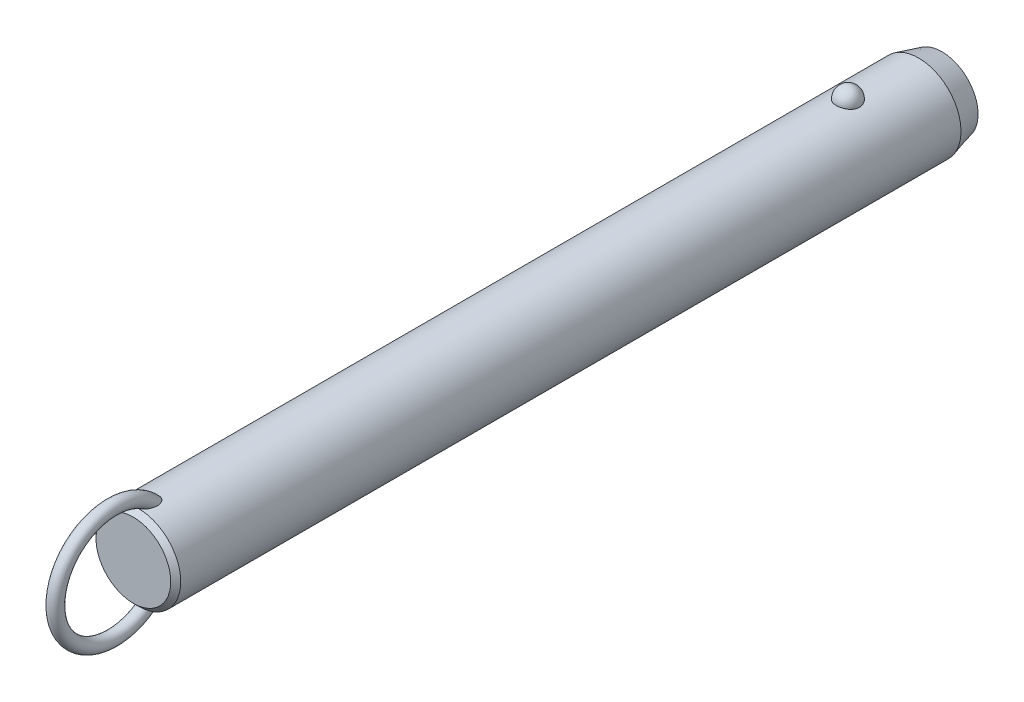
ISO-10303-21;
HEADER;
FILE_DESCRIPTION(('STEP AP214'),'2;1');
FILE_NAME('part.step','',(''),(''),'','','');
FILE_SCHEMA(('AUTOMOTIVE_DESIGN { 1 0 10303 214 1 1 1 1 }'));
ENDSEC;
DATA;
#1=APPLICATION_CONTEXT('core data for automotive mechanical design processes');
#2=APPLICATION_PROTOCOL_DEFINITION('international standard','automotive_design',2000,#1);
#3=PRODUCT_CONTEXT('',#1,'mechanical');
#4=PRODUCT('Part','Part','',(#3));
#5=PRODUCT_RELATED_PRODUCT_CATEGORY('part','',(#4));
#6=PRODUCT_DEFINITION_FORMATION('','',#4);
#7=PRODUCT_DEFINITION_CONTEXT('part definition',#1,'design');
#8=PRODUCT_DEFINITION('design','',#6,#7);
#9=PRODUCT_DEFINITION_SHAPE('','',#8);
#10=(LENGTH_UNIT() NAMED_UNIT(*) SI_UNIT(.MILLI.,.METRE.));
#11=(NAMED_UNIT(*) PLANE_ANGLE_UNIT() SI_UNIT($,.RADIAN.));
#12=(NAMED_UNIT(*) SI_UNIT($,.STERADIAN.) SOLID_ANGLE_UNIT());
#13=UNCERTAINTY_MEASURE_WITH_UNIT(LENGTH_MEASURE(1.E-05),#10,'distance_accuracy_value','');
#14=(GEOMETRIC_REPRESENTATION_CONTEXT(3) GLOBAL_UNCERTAINTY_ASSIGNED_CONTEXT((#13)) GLOBAL_UNIT_ASSIGNED_CONTEXT((#10,
#11,#12)) REPRESENTATION_CONTEXT('',''));
#15=CARTESIAN_POINT('',(0.,0.,0.));
#16=DIRECTION('',(0.,0.,1.));
#17=DIRECTION('',(1.,0.,0.));
#18=AXIS2_PLACEMENT_3D('',#15,#16,#17);
#19=CARTESIAN_POINT('',(0.,0.,198.1));
#20=DIRECTION('',(0.,0.,-1.));
#21=DIRECTION('',(-1.,0.,0.));
#22=AXIS2_PLACEMENT_3D('',#19,#20,#21);
#23=CYLINDRICAL_SURFACE('',#22,12.7);
#24=CARTESIAN_POINT('',(3.46661256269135,12.2177165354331,-3.50000000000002));
#25=CARTESIAN_POINT('',(3.4666090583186,12.2177194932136,-3.30432790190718));
#26=CARTESIAN_POINT('',(3.45063567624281,12.2222841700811,-3.10861112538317));
#27=CARTESIAN_POINT('',(3.38712451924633,12.2400345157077,-2.72271899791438));
#28=CARTESIAN_POINT('',(3.33957415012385,12.2532236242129,-2.53254588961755));
#29=CARTESIAN_POINT('',(3.2141234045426,12.286724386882,-2.16324948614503));
#30=CARTESIAN_POINT('',(3.13623639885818,12.3070329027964,-1.98412136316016));
#31=CARTESIAN_POINT('',(2.95205930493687,12.3525018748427,-1.6418059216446));
#32=CARTESIAN_POINT('',(2.84577003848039,12.3776621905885,-1.47861814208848));
#33=CARTESIAN_POINT('',(2.60688050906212,12.4301712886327,-1.17190583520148));
#34=CARTESIAN_POINT('',(2.47415697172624,12.4575299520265,-1.0284789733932));
#35=CARTESIAN_POINT('',(2.18615174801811,12.5112810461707,-0.766177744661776));
#36=CARTESIAN_POINT('',(2.03087002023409,12.5376734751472,-0.647303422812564));
#37=CARTESIAN_POINT('',(1.70237334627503,12.5864761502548,-0.437732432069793));
#38=CARTESIAN_POINT('',(1.52920948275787,12.6088972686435,-0.346958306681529));
#39=CARTESIAN_POINT('',(1.16944170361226,12.6473352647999,-0.195750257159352));
#40=CARTESIAN_POINT('',(0.982839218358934,12.663352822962,-0.135313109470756));
#41=CARTESIAN_POINT('',(0.604961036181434,12.6869706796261,-0.0473241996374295));
#42=CARTESIAN_POINT('',(0.41382314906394,12.6947125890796,-0.0192185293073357));
#43=CARTESIAN_POINT('',(0.0293827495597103,12.7014203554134,0.00517254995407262));
#44=CARTESIAN_POINT('',(-0.163919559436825,12.7003870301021,0.00146092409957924));
#45=CARTESIAN_POINT('',(-0.544374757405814,12.689735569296,-0.0373939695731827));
#46=CARTESIAN_POINT('',(-0.731575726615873,12.6802364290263,-0.0721015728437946));
#47=CARTESIAN_POINT('',(-1.09733277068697,12.6538333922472,-0.171364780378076));
#48=CARTESIAN_POINT('',(-1.27588869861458,12.6369293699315,-0.235920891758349));
#49=CARTESIAN_POINT('',(-1.6204698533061,12.5973946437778,-0.393548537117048));
#50=CARTESIAN_POINT('',(-1.78641865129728,12.5747321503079,-0.486778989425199));
#51=CARTESIAN_POINT('',(-2.10030671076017,12.5261316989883,-0.699110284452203));
#52=CARTESIAN_POINT('',(-2.24824419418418,12.5001934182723,-0.818213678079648));
#53=CARTESIAN_POINT('',(-2.52491489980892,12.4472906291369,-1.0815712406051));
#54=CARTESIAN_POINT('',(-2.65324222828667,12.4203160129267,-1.22624992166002));
#55=CARTESIAN_POINT('',(-2.88410007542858,12.3687509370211,-1.53528325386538));
#56=CARTESIAN_POINT('',(-2.98662883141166,12.3441606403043,-1.69963924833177));
#57=CARTESIAN_POINT('',(-3.16432417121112,12.2998199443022,-2.04548497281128));
#58=CARTESIAN_POINT('',(-3.23917525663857,12.2801261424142,-2.22714424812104));
#59=CARTESIAN_POINT('',(-3.35800573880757,12.248167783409,-2.60091389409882));
#60=CARTESIAN_POINT('',(-3.4019860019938,12.2359030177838,-2.79302397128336));
#61=CARTESIAN_POINT('',(-3.45784812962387,12.2202347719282,-3.18140279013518));
#62=CARTESIAN_POINT('',(-3.46986123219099,12.2167950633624,-3.37765118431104));
#63=CARTESIAN_POINT('',(-3.46186273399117,12.2190638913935,-3.76943689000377));
#64=CARTESIAN_POINT('',(-3.44185196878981,12.2247721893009,-3.96497421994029));
#65=CARTESIAN_POINT('',(-3.37048652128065,12.2446381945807,-4.34881728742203));
#66=CARTESIAN_POINT('',(-3.31928253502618,12.2587552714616,-4.53715319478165));
#67=CARTESIAN_POINT('',(-3.18693461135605,12.2938237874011,-4.9023172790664));
#68=CARTESIAN_POINT('',(-3.1057895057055,12.3147754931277,-5.07914500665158));
#69=CARTESIAN_POINT('',(-2.91506431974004,12.3613125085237,-5.41732059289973));
#70=CARTESIAN_POINT('',(-2.80533587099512,12.3869217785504,-5.57858147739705));
#71=CARTESIAN_POINT('',(-2.560414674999,12.4398525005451,-5.88013283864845));
#72=CARTESIAN_POINT('',(-2.42522099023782,12.4671740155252,-6.02042254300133));
#73=CARTESIAN_POINT('',(-2.1323357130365,12.5205965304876,-6.27662798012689));
#74=CARTESIAN_POINT('',(-1.97456596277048,12.5466928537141,-6.39245542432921));
#75=CARTESIAN_POINT('',(-1.64115839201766,12.5946384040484,-6.59583547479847));
#76=CARTESIAN_POINT('',(-1.46552179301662,12.6164879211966,-6.68339001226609));
#77=CARTESIAN_POINT('',(-1.10356050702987,12.6532533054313,-6.82682153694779));
#78=CARTESIAN_POINT('',(-0.9173913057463,12.6682500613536,-6.88306988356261));
#79=CARTESIAN_POINT('',(-0.537836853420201,12.6900288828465,-6.96386887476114));
#80=CARTESIAN_POINT('',(-0.344452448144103,12.6968119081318,-6.98842322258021));
#81=CARTESIAN_POINT('',(0.0402577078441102,12.7013667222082,-7.00496469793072));
#82=CARTESIAN_POINT('',(0.231556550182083,12.6993008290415,-6.99753844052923));
#83=CARTESIAN_POINT('',(0.610105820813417,12.6867505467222,-6.95166366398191));
#84=CARTESIAN_POINT('',(0.797356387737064,12.6762664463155,-6.91321620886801));
#85=CARTESIAN_POINT('',(1.16186657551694,12.6480587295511,-6.80658431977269));
#86=CARTESIAN_POINT('',(1.33915951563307,12.6303611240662,-6.73850666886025));
#87=CARTESIAN_POINT('',(1.67968518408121,12.5896027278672,-6.57450875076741));
#88=CARTESIAN_POINT('',(1.84291705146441,12.5665416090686,-6.47858678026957));
#89=CARTESIAN_POINT('',(2.15340192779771,12.5171072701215,-6.25982455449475));
#90=CARTESIAN_POINT('',(2.30037831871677,12.4906895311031,-6.13660186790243));
#91=CARTESIAN_POINT('',(2.5717412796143,12.4376567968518,-5.86739587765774));
#92=CARTESIAN_POINT('',(2.69612388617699,12.4110417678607,-5.72140858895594));
#93=CARTESIAN_POINT('',(2.92107785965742,12.360051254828,-5.40794137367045));
#94=CARTESIAN_POINT('',(3.02121329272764,12.3357209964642,-5.24014110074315));
#95=CARTESIAN_POINT('',(3.19236291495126,12.2925446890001,-4.88969865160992));
#96=CARTESIAN_POINT('',(3.26338839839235,12.2736965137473,-4.70706226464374));
#97=CARTESIAN_POINT('',(3.36788038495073,12.245404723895,-4.35469510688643));
#98=CARTESIAN_POINT('',(3.40484026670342,12.2351018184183,-4.18605935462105));
#99=CARTESIAN_POINT('',(3.45420764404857,12.2212564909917,-3.84496058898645));
#100=CARTESIAN_POINT('',(3.46661565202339,12.2177139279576,-3.67249765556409));
#101=CARTESIAN_POINT('',(3.46661256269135,12.2177165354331,-3.50000000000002));
#102=B_SPLINE_CURVE_WITH_KNOTS('',3,(#24,#25,#26,#27,#28,#29,#30,#31,#32,#33,#34,#35,#36,#37,
#38,#39,#40,#41,#42,#43,#44,#45,#46,#47,#48,#49,#50,#51,#52,#53,#54,#55,#56,#57,#58,#59,#60,#61,
#62,#63,#64,#65,#66,#67,#68,#69,#70,#71,#72,#73,#74,#75,#76,#77,#78,#79,#80,#81,#82,#83,#84,#85,
#86,#87,#88,#89,#90,#91,#92,#93,#94,#95,#96,#97,#98,#99,#100,#101),.UNSPECIFIED.,.T.,.F.,(4,2,2,
2,2,2,2,2,2,2,2,2,2,2,2,2,2,2,2,2,2,2,2,2,2,2,2,2,2,2,2,2,2,2,2,2,2,2,4),(0.,0.586396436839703,
1.17302689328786,1.7593990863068,2.34575431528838,2.93491084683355,3.52406845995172,
4.11158733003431,4.69904375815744,5.2762784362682,5.85345931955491,6.42265312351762,
6.99185659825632,7.56427334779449,8.136746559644,8.71981013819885,9.3029135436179,
9.89247258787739,10.4820150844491,11.0691335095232,11.6562366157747,12.2405256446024,
12.8248374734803,13.412244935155,13.9996740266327,14.5891883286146,15.1786623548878,
15.7609861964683,16.3432419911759,16.9148635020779,17.4864654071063,18.0560241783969,
18.6256177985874,19.2037609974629,19.7820055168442,20.3699810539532,20.957728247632,
21.4746855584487,21.9916320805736),.UNSPECIFIED.);
#103=CARTESIAN_POINT('',(3.46661256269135,12.2177165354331,-3.50000000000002));
#104=VERTEX_POINT('',#103);
#105=EDGE_CURVE('E41',#104,#104,#102,.T.);
#106=ORIENTED_EDGE('',*,*,#105,.T.);
#107=EDGE_LOOP('',(#106));
#108=FACE_BOUND('',#107,.T.);
#109=CARTESIAN_POINT('',(0.,0.,209.3));
#110=DIRECTION('',(0.,0.,1.));
#111=DIRECTION('',(1.,0.,0.));
#112=AXIS2_PLACEMENT_3D('',#109,#110,#111);
#113=CIRCLE('',#112,12.7);
#114=CARTESIAN_POINT('',(12.7,0.,209.3));
#115=VERTEX_POINT('',#114);
#116=EDGE_CURVE('E10',#115,#115,#113,.F.);
#117=ORIENTED_EDGE('',*,*,#116,.T.);
#118=EDGE_LOOP('',(#117));
#119=FACE_BOUND('',#118,.T.);
#120=CARTESIAN_POINT('',(-0.548122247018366,-12.6881662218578,203.043218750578));
#121=CARTESIAN_POINT('',(-0.648865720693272,-12.6838128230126,203.077926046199));
#122=CARTESIAN_POINT('',(-0.746398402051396,-12.6783867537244,203.122042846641));
#123=CARTESIAN_POINT('',(-0.932125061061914,-12.666091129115,203.226764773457));
#124=CARTESIAN_POINT('',(-1.02030388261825,-12.6592192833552,203.287396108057));
#125=CARTESIAN_POINT('',(-1.18487740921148,-12.6448747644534,203.421847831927));
#126=CARTESIAN_POINT('',(-1.26134296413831,-12.637406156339,203.495582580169));
#127=CARTESIAN_POINT('',(-1.4023120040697,-12.6225412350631,203.653604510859));
#128=CARTESIAN_POINT('',(-1.466814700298,-12.6151449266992,203.73789238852));
#129=CARTESIAN_POINT('',(-1.60714786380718,-12.5981718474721,203.949657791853));
#130=CARTESIAN_POINT('',(-1.67725126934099,-12.588900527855,204.080962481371));
#131=CARTESIAN_POINT('',(-1.79536591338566,-12.5725964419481,204.353247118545));
#132=CARTESIAN_POINT('',(-1.84333535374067,-12.5655679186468,204.494244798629));
#133=CARTESIAN_POINT('',(-1.93422576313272,-12.5519624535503,204.837645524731));
#134=CARTESIAN_POINT('',(-1.96788773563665,-12.5466298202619,205.042557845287));
#135=CARTESIAN_POINT('',(-1.9941399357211,-12.542463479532,205.351760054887));
#136=CARTESIAN_POINT('',(-1.99883864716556,-12.5417153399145,205.455298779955));
#137=CARTESIAN_POINT('',(-2.00078003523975,-12.5414074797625,205.66245124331));
#138=CARTESIAN_POINT('',(-1.99802449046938,-12.5418474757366,205.766064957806));
#139=CARTESIAN_POINT('',(-1.98336733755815,-12.5441750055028,206.01032076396));
#140=CARTESIAN_POINT('',(-1.96851430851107,-12.5465291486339,206.150780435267));
#141=CARTESIAN_POINT('',(-1.92707089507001,-12.5529612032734,206.429960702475));
#142=CARTESIAN_POINT('',(-1.90047458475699,-12.5570399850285,206.568680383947));
#143=CARTESIAN_POINT('',(-1.8361912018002,-12.5666008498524,206.84341135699));
#144=CARTESIAN_POINT('',(-1.79850828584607,-12.57208240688,206.979423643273));
#145=CARTESIAN_POINT('',(-1.71223796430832,-12.5841228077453,207.247842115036));
#146=CARTESIAN_POINT('',(-1.66365679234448,-12.5906810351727,207.380250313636));
#147=CARTESIAN_POINT('',(-1.5780450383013,-12.6016176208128,207.58548877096));
#148=CARTESIAN_POINT('',(-1.54477252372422,-12.6057501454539,207.659914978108));
#149=CARTESIAN_POINT('',(-1.47424480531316,-12.6141930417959,207.806839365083));
#150=CARTESIAN_POINT('',(-1.436990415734,-12.6185033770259,207.879337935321));
#151=CARTESIAN_POINT('',(-1.35825795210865,-12.6272207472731,208.021892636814));
#152=CARTESIAN_POINT('',(-1.31678520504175,-12.6316276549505,208.091951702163));
#153=CARTESIAN_POINT('',(-1.22917793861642,-12.6404532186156,208.229070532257));
#154=CARTESIAN_POINT('',(-1.18304514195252,-12.6448718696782,208.296131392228));
#155=CARTESIAN_POINT('',(-1.0724641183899,-12.6547893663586,208.443874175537));
#156=CARTESIAN_POINT('',(-1.00642239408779,-12.6602600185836,208.523384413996));
#157=CARTESIAN_POINT('',(-0.864441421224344,-12.6707460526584,208.673169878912));
#158=CARTESIAN_POINT('',(-0.788516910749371,-12.6757620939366,208.743458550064));
#159=CARTESIAN_POINT('',(-0.652215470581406,-12.6833591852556,208.848680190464));
#160=CARTESIAN_POINT('',(-0.594982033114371,-12.6861973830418,208.887624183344));
#161=CARTESIAN_POINT('',(-0.475269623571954,-12.6912445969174,208.956489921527));
#162=CARTESIAN_POINT('',(-0.412800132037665,-12.6934547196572,208.986427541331));
#163=CARTESIAN_POINT('',(-0.29574972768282,-12.6966636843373,209.02975652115));
#164=CARTESIAN_POINT('',(-0.241949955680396,-12.6978134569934,209.045218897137));
#165=CARTESIAN_POINT('',(-0.132508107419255,-12.6994261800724,209.066884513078));
#166=CARTESIAN_POINT('',(-0.0768679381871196,-12.6998898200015,209.073097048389));
#167=CARTESIAN_POINT('',(0.0347696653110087,-12.7000752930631,209.075583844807));
#168=CARTESIAN_POINT('',(0.0907676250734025,-12.6997954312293,209.071835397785));
#169=CARTESIAN_POINT('',(0.201283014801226,-12.6985255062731,209.054788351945));
#170=CARTESIAN_POINT('',(0.255799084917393,-12.6975348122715,209.041481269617));
#171=CARTESIAN_POINT('',(0.376042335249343,-12.6946091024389,209.00203792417));
#172=CARTESIAN_POINT('',(0.440950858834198,-12.6924943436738,208.973449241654));
#173=CARTESIAN_POINT('',(0.565350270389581,-12.6875639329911,208.906323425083));
#174=CARTESIAN_POINT('',(0.624828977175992,-12.6847467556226,208.867764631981));
#175=CARTESIAN_POINT('',(0.774116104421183,-12.6767252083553,208.756949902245));
#176=CARTESIAN_POINT('',(0.859449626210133,-12.6711344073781,208.678760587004));
#177=CARTESIAN_POINT('',(1.01789440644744,-12.6593922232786,208.510943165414));
#178=CARTESIAN_POINT('',(1.09096902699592,-12.653239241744,208.421282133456));
#179=CARTESIAN_POINT('',(1.22268793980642,-12.6411674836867,208.240265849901));
#180=CARTESIAN_POINT('',(1.28193986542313,-12.6352572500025,208.149345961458));
#181=CARTESIAN_POINT('',(1.39259777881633,-12.6235401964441,207.962792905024));
#182=CARTESIAN_POINT('',(1.44399707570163,-12.6177334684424,207.867155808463));
#183=CARTESIAN_POINT('',(1.53972870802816,-12.6064093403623,207.672273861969));
#184=CARTESIAN_POINT('',(1.58405262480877,-12.6008922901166,207.573024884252));
#185=CARTESIAN_POINT('',(1.66600705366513,-12.5903187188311,207.371772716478));
#186=CARTESIAN_POINT('',(1.70363651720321,-12.5852622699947,207.269769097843));
#187=CARTESIAN_POINT('',(1.77545379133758,-12.5753406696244,207.054358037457));
#188=CARTESIAN_POINT('',(1.80903453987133,-12.5705328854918,206.940745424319));
#189=CARTESIAN_POINT('',(1.86844163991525,-12.5618400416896,206.711457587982));
#190=CARTESIAN_POINT('',(1.89426665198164,-12.5579551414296,206.595782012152));
#191=CARTESIAN_POINT('',(1.9378546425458,-12.5513030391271,206.363007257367));
#192=CARTESIAN_POINT('',(1.9556264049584,-12.5485346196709,206.245909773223));
#193=CARTESIAN_POINT('',(1.98264463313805,-12.5442934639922,206.010747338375));
#194=CARTESIAN_POINT('',(1.99189298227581,-12.5428204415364,205.89268260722));
#195=CARTESIAN_POINT('',(2.00416068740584,-12.540871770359,205.580622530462));
#196=CARTESIAN_POINT('',(1.99944433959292,-12.541631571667,205.386229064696));
#197=CARTESIAN_POINT('',(1.96113755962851,-12.5476846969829,205.000309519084));
#198=CARTESIAN_POINT('',(1.92758341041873,-12.5529723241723,204.808780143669));
#199=CARTESIAN_POINT('',(1.83934342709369,-12.5661532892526,204.482272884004));
#200=CARTESIAN_POINT('',(1.79215440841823,-12.5730485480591,204.34524997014));
#201=CARTESIAN_POINT('',(1.67676242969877,-12.588958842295,204.080445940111));
#202=CARTESIAN_POINT('',(1.60859050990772,-12.597970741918,203.952651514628));
#203=CARTESIAN_POINT('',(1.46583832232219,-12.6152829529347,203.735800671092));
#204=CARTESIAN_POINT('',(1.39525727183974,-12.6233659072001,203.64410500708));
#205=CARTESIAN_POINT('',(1.23992594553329,-12.6395676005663,203.473485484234));
#206=CARTESIAN_POINT('',(1.15517932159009,-12.6476863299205,203.394558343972));
#207=CARTESIAN_POINT('',(0.971995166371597,-12.6630846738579,203.252643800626));
#208=CARTESIAN_POINT('',(0.873456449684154,-12.6703572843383,203.189784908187));
#209=CARTESIAN_POINT('',(0.665847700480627,-12.6829569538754,203.084487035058));
#210=CARTESIAN_POINT('',(0.556784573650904,-12.688285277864,203.042034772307));
#211=CARTESIAN_POINT('',(0.347338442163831,-12.6956226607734,202.984443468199));
#212=CARTESIAN_POINT('',(0.247759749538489,-12.6979816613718,202.966399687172));
#213=CARTESIAN_POINT('',(0.0470218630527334,-12.7003077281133,202.948600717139));
#214=CARTESIAN_POINT('',(-0.0541350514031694,-12.7002779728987,202.948821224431));
#215=CARTESIAN_POINT('',(-0.221414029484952,-12.6982482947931,202.964363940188));
#216=CARTESIAN_POINT('',(-0.288055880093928,-12.6969033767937,202.974666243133));
#217=CARTESIAN_POINT('',(-0.419599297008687,-12.6932369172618,203.00313489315));
#218=CARTESIAN_POINT('',(-0.484501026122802,-12.6909154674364,203.021300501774));
#219=CARTESIAN_POINT('',(-0.548122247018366,-12.6881662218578,203.043218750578));
#220=B_SPLINE_CURVE_WITH_KNOTS('',3,(#120,#121,#122,#123,#124,#125,#126,#127,#128,#129,#130,
#131,#132,#133,#134,#135,#136,#137,#138,#139,#140,#141,#142,#143,#144,#145,#146,#147,#148,#149,
#150,#151,#152,#153,#154,#155,#156,#157,#158,#159,#160,#161,#162,#163,#164,#165,#166,#167,#168,
#169,#170,#171,#172,#173,#174,#175,#176,#177,#178,#179,#180,#181,#182,#183,#184,#185,#186,#187,
#188,#189,#190,#191,#192,#193,#194,#195,#196,#197,#198,#199,#200,#201,#202,#203,#204,#205,#206,
#207,#208,#209,#210,#211,#212,#213,#214,#215,#216,#217,#218,#219),.UNSPECIFIED.,.T.,.F.,(4,2,2,
2,2,2,2,2,2,2,2,2,2,2,2,2,2,2,2,2,2,2,2,2,2,2,2,2,2,2,2,2,2,2,2,2,2,2,2,2,2,2,2,2,2,2,2,2,2,4),
(0.,0.31964225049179,0.639794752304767,0.957927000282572,1.27608021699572,1.72100165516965,
2.16675988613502,2.78630021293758,3.09705782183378,3.40774128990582,3.8309635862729,
4.25439969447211,4.67767724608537,5.10071330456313,5.34550297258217,5.59024267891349,
5.83467707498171,6.07902143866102,6.38891080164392,6.69834321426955,6.90560910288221,
7.11250749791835,7.27977315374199,7.44687060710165,7.61434932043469,7.78197685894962,
7.99365544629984,8.20579780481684,8.55147335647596,8.89816429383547,9.22375138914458,
9.54961437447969,9.87586224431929,10.202161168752,10.557587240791,10.9130746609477,
11.2681734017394,11.6231936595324,12.2046601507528,12.7853961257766,13.219164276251,
13.6522938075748,13.9989174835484,14.3454519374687,14.6946768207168,15.0436740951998,
15.3457513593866,15.6474266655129,15.8493051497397,16.0511646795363),.UNSPECIFIED.);
#221=CARTESIAN_POINT('',(-0.548122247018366,-12.6881662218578,203.043218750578));
#222=VERTEX_POINT('',#221);
#223=EDGE_CURVE('E60',#222,#222,#220,.T.);
#224=ORIENTED_EDGE('',*,*,#223,.T.);
#225=EDGE_LOOP('',(#224));
#226=FACE_BOUND('',#225,.T.);
#227=CARTESIAN_POINT('',(-0.548122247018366,12.6881662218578,203.043218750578));
#228=CARTESIAN_POINT('',(-0.459436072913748,12.6919968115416,203.012673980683));
#229=CARTESIAN_POINT('',(-0.368189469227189,12.6949996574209,202.989391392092));
#230=CARTESIAN_POINT('',(-0.183024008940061,12.6990186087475,202.958406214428));
#231=CARTESIAN_POINT('',(-0.0891049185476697,12.7000345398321,202.950704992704));
#232=CARTESIAN_POINT('',(0.0987147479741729,12.6999636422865,202.951245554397));
#233=CARTESIAN_POINT('',(0.192615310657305,12.6988761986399,202.959492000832));
#234=CARTESIAN_POINT('',(0.377658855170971,12.6947211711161,202.991551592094));
#235=CARTESIAN_POINT('',(0.468801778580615,12.6916535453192,203.015365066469));
#236=CARTESIAN_POINT('',(0.645809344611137,12.6838788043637,203.07745651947));
#237=CARTESIAN_POINT('',(0.731679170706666,12.6791733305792,203.115720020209));
#238=CARTESIAN_POINT('',(0.896315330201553,12.6686004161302,203.205120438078));
#239=CARTESIAN_POINT('',(0.97508059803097,12.6627328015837,203.256259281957));
#240=CARTESIAN_POINT('',(1.12963655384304,12.6499161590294,203.37367820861));
#241=CARTESIAN_POINT('',(1.20478673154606,12.6429194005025,203.440792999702));
#242=CARTESIAN_POINT('',(1.34448241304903,12.6288282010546,203.58522507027));
#243=CARTESIAN_POINT('',(1.40902173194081,12.621733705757,203.662548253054));
#244=CARTESIAN_POINT('',(1.55208211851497,12.6050877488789,203.859247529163));
#245=CARTESIAN_POINT('',(1.62510490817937,12.5957546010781,203.982654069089));
#246=CARTESIAN_POINT('',(1.7501904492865,12.5789823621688,204.239769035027));
#247=CARTESIAN_POINT('',(1.8022137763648,12.5715468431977,204.373496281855));
#248=CARTESIAN_POINT('',(1.90309965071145,12.5567434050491,204.698351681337));
#249=CARTESIAN_POINT('',(1.94342317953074,12.5504515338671,204.892161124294));
#250=CARTESIAN_POINT('',(1.99332997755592,12.5426147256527,205.28378810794));
#251=CARTESIAN_POINT('',(2.00285305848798,12.5410790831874,205.481612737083));
#252=CARTESIAN_POINT('',(1.99678999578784,12.5420407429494,205.816642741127));
#253=CARTESIAN_POINT('',(1.98794117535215,12.5434564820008,205.954042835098));
#254=CARTESIAN_POINT('',(1.95865119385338,12.5480641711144,206.227639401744));
#255=CARTESIAN_POINT('',(1.93820436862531,12.5512569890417,206.363835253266));
#256=CARTESIAN_POINT('',(1.88647896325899,12.5591352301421,206.634249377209));
#257=CARTESIAN_POINT('',(1.85518800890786,12.5638223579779,206.768465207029));
#258=CARTESIAN_POINT('',(1.78217886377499,12.5743868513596,207.033936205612));
#259=CARTESIAN_POINT('',(1.74046509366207,12.5802637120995,207.165192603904));
#260=CARTESIAN_POINT('',(1.66024095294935,12.5910571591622,207.386085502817));
#261=CARTESIAN_POINT('',(1.62434772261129,12.5957535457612,207.476690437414));
#262=CARTESIAN_POINT('',(1.54709009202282,12.6054762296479,207.655512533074));
#263=CARTESIAN_POINT('',(1.50572681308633,12.6105024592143,207.743730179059));
#264=CARTESIAN_POINT('',(1.41728020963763,12.620748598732,207.916932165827));
#265=CARTESIAN_POINT('',(1.37021377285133,12.625967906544,208.001925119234));
#266=CARTESIAN_POINT('',(1.26969620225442,12.6364721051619,208.168007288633));
#267=CARTESIAN_POINT('',(1.21624929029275,12.6417569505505,208.249099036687));
#268=CARTESIAN_POINT('',(1.10304413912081,12.6521331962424,208.404702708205));
#269=CARTESIAN_POINT('',(1.04340936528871,12.657226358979,208.479303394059));
#270=CARTESIAN_POINT('',(0.915919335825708,12.667090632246,208.621324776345));
#271=CARTESIAN_POINT('',(0.848064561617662,12.6718617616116,208.68874589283));
#272=CARTESIAN_POINT('',(0.717035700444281,12.67987711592,208.800624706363));
#273=CARTESIAN_POINT('',(0.655526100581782,12.6832377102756,208.846997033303));
#274=CARTESIAN_POINT('',(0.525985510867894,12.6892676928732,208.929619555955));
#275=CARTESIAN_POINT('',(0.457969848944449,12.6919386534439,208.965892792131));
#276=CARTESIAN_POINT('',(0.334859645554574,12.695691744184,209.016657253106));
#277=CARTESIAN_POINT('',(0.281116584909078,12.6970073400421,209.034373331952));
#278=CARTESIAN_POINT('',(0.171425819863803,12.6989609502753,209.060642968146));
#279=CARTESIAN_POINT('',(0.115480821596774,12.699599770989,209.069207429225));
#280=CARTESIAN_POINT('',(0.00272618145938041,12.7001251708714,209.076253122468));
#281=CARTESIAN_POINT('',(-0.0540859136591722,12.7000089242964,209.074696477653));
#282=CARTESIAN_POINT('',(-0.16654462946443,12.6990328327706,209.061600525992));
#283=CARTESIAN_POINT('',(-0.222190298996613,12.6981724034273,209.050053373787));
#284=CARTESIAN_POINT('',(-0.342018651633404,12.695562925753,209.014912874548));
#285=CARTESIAN_POINT('',(-0.405606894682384,12.6936676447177,208.98933225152));
#286=CARTESIAN_POINT('',(-0.527815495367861,12.6891754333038,208.928311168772));
#287=CARTESIAN_POINT('',(-0.586425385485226,12.6865770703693,208.892850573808));
#288=CARTESIAN_POINT('',(-0.731842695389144,12.6792129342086,208.791496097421));
#289=CARTESIAN_POINT('',(-0.81470941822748,12.6740767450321,208.7200395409));
#290=CARTESIAN_POINT('',(-0.969101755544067,12.6632083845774,208.56589007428));
#291=CARTESIAN_POINT('',(-1.04059564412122,12.6574746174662,208.483166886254));
#292=CARTESIAN_POINT('',(-1.16981116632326,12.6461638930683,208.315809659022));
#293=CARTESIAN_POINT('',(-1.22811369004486,12.6405994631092,208.231616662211));
#294=CARTESIAN_POINT('',(-1.33743405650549,12.6295007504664,208.058579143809));
#295=CARTESIAN_POINT('',(-1.38844577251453,12.6239664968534,207.969730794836));
#296=CARTESIAN_POINT('',(-1.48400702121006,12.6130898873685,207.788389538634));
#297=CARTESIAN_POINT('',(-1.52854232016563,12.6077479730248,207.695889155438));
#298=CARTESIAN_POINT('',(-1.61150113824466,12.5974127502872,207.508160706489));
#299=CARTESIAN_POINT('',(-1.64992317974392,12.5924195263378,207.412931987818));
#300=CARTESIAN_POINT('',(-1.73468589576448,12.581070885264,207.18289362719));
#301=CARTESIAN_POINT('',(-1.77831261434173,12.5749388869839,207.047066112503));
#302=CARTESIAN_POINT('',(-1.85439734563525,12.5639437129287,206.772212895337));
#303=CARTESIAN_POINT('',(-1.88684994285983,12.5590811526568,206.633185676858));
#304=CARTESIAN_POINT('',(-1.94008483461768,12.550968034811,206.35309235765));
#305=CARTESIAN_POINT('',(-1.96088706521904,12.5477147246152,206.212030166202));
#306=CARTESIAN_POINT('',(-1.99000539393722,12.5431291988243,205.928668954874));
#307=CARTESIAN_POINT('',(-1.99832911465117,12.5417958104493,205.786370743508));
#308=CARTESIAN_POINT('',(-2.00166624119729,12.5412674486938,205.457627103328));
#309=CARTESIAN_POINT('',(-1.99178843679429,12.5428579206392,205.271088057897));
#310=CARTESIAN_POINT('',(-1.94455183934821,12.5502731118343,204.90162404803));
#311=CARTESIAN_POINT('',(-1.90724032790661,12.5560905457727,204.718693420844));
#312=CARTESIAN_POINT('',(-1.81330718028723,12.5699462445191,204.404848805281));
#313=CARTESIAN_POINT('',(-1.76338820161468,12.5771273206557,204.271910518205));
#314=CARTESIAN_POINT('',(-1.64305018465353,12.593414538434,204.015681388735));
#315=CARTESIAN_POINT('',(-1.57265346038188,12.6025185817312,203.892380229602));
#316=CARTESIAN_POINT('',(-1.42634956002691,12.6198178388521,203.683564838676));
#317=CARTESIAN_POINT('',(-1.35423772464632,12.6278405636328,203.595384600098));
#318=CARTESIAN_POINT('',(-1.19645664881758,12.6437632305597,203.432107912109));
#319=CARTESIAN_POINT('',(-1.1108053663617,12.6516633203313,203.356994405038));
#320=CARTESIAN_POINT('',(-0.947219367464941,12.6648319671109,203.237811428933));
#321=CARTESIAN_POINT('',(-0.871624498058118,12.670300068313,203.190541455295));
#322=CARTESIAN_POINT('',(-0.714161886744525,12.6801492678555,203.1077413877));
#323=CARTESIAN_POINT('',(-0.632295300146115,12.684530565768,203.07220913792));
#324=CARTESIAN_POINT('',(-0.548122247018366,12.6881662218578,203.043218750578));
#325=B_SPLINE_CURVE_WITH_KNOTS('',3,(#227,#228,#229,#230,#231,#232,#233,#234,#235,#236,#237,
#238,#239,#240,#241,#242,#243,#244,#245,#246,#247,#248,#249,#250,#251,#252,#253,#254,#255,#256,
#257,#258,#259,#260,#261,#262,#263,#264,#265,#266,#267,#268,#269,#270,#271,#272,#273,#274,#275,
#276,#277,#278,#279,#280,#281,#282,#283,#284,#285,#286,#287,#288,#289,#290,#291,#292,#293,#294,
#295,#296,#297,#298,#299,#300,#301,#302,#303,#304,#305,#306,#307,#308,#309,#310,#311,#312,#313,
#314,#315,#316,#317,#318,#319,#320,#321,#322,#323,#324),.UNSPECIFIED.,.T.,.F.,(4,2,2,2,2,2,2,2,
2,2,2,2,2,2,2,2,2,2,2,2,2,2,2,2,2,2,2,2,2,2,2,2,2,2,2,2,2,2,2,2,2,2,2,2,2,2,2,2,4),(0.,
0.281328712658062,0.562682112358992,0.844117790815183,1.12555942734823,1.40671982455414,
1.68792232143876,1.98972294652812,2.29169886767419,2.72039860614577,3.14989948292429,
3.74084916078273,4.33295293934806,4.74554109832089,5.15833092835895,5.57159335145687,
5.98468079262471,6.27722775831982,6.56971484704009,6.86135609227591,7.15280542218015,
7.43927407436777,7.72572595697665,7.95635862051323,8.18646071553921,8.35559393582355,
8.52452541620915,8.69408946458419,8.86378678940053,9.06834348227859,9.27332014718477,
9.60010414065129,9.92778432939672,10.2350252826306,10.5425229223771,10.8506864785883,
11.15892440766,11.5867893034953,12.0148612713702,12.4421984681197,12.8692745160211,
13.4279365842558,13.9856380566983,14.4107062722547,14.835313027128,15.1765567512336,
15.517351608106,15.7844129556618,16.051425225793),.UNSPECIFIED.);
#326=CARTESIAN_POINT('',(-0.548122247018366,12.6881662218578,203.043218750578));
#327=VERTEX_POINT('',#326);
#328=EDGE_CURVE('E68',#327,#327,#325,.T.);
#329=ORIENTED_EDGE('',*,*,#328,.T.);
#330=EDGE_LOOP('',(#329));
#331=FACE_BOUND('',#330,.T.);
#332=CARTESIAN_POINT('',(0.,0.,-24.6999999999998));
#333=DIRECTION('',(0.,0.,-1.));
#334=DIRECTION('',(-1.,0.,0.));
#335=AXIS2_PLACEMENT_3D('',#332,#333,#334);
#336=CIRCLE('',#335,12.7);
#337=CARTESIAN_POINT('',(-12.7,0.,-24.6999999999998));
#338=VERTEX_POINT('',#337);
#339=EDGE_CURVE('E57',#338,#338,#336,.F.);
#340=ORIENTED_EDGE('',*,*,#339,.T.);
#341=EDGE_LOOP('',(#340));
#342=FACE_BOUND('',#341,.T.);
#343=ADVANCED_FACE('F37',(#108,#119,#226,#331,#342),#23,.T.);
#344=CARTESIAN_POINT('',(0.,0.,-31.7));
#345=DIRECTION('',(0.,0.,-1.));
#346=DIRECTION('',(-1.,0.,0.));
#347=AXIS2_PLACEMENT_3D('',#344,#345,#346);
#348=PLANE('',#347);
#349=CARTESIAN_POINT('',(0.,0.,-31.7));
#350=DIRECTION('',(0.,0.,-1.));
#351=DIRECTION('',(-1.,0.,0.));
#352=AXIS2_PLACEMENT_3D('',#349,#350,#351);
#353=CIRCLE('',#352,10.8243556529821);
#354=CARTESIAN_POINT('',(-10.8243556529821,0.,-31.7));
#355=VERTEX_POINT('',#354);
#356=EDGE_CURVE('E67',#355,#355,#353,.T.);
#357=ORIENTED_EDGE('',*,*,#356,.T.);
#358=EDGE_LOOP('',(#357));
#359=FACE_BOUND('',#358,.T.);
#360=ADVANCED_FACE('F86',(#359),#348,.T.);
#361=CARTESIAN_POINT('',(0.,0.,-31.7));
#362=DIRECTION('',(0.,0.,1.));
#363=DIRECTION('',(1.,0.,0.));
#364=AXIS2_PLACEMENT_3D('',#361,#362,#363);
#365=CONICAL_SURFACE('',#364,10.8243556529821,0.261799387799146);
#366=ORIENTED_EDGE('',*,*,#339,.F.);
#367=EDGE_LOOP('',(#366));
#368=FACE_BOUND('',#367,.T.);
#369=ORIENTED_EDGE('',*,*,#356,.F.);
#370=EDGE_LOOP('',(#369));
#371=FACE_BOUND('',#370,.T.);
#372=ADVANCED_FACE('F84',(#368,#371),#365,.T.);
#373=CARTESIAN_POINT('',(0.,0.,210.8));
#374=DIRECTION('',(0.,0.,1.));
#375=DIRECTION('',(1.,0.,0.));
#376=AXIS2_PLACEMENT_3D('',#373,#374,#375);
#377=PLANE('',#376);
#378=CARTESIAN_POINT('',(0.,0.,210.8));
#379=DIRECTION('',(0.,0.,1.));
#380=DIRECTION('',(1.,0.,0.));
#381=AXIS2_PLACEMENT_3D('',#378,#379,#380);
#382=CIRCLE('',#381,11.2);
#383=CARTESIAN_POINT('',(11.2,0.,210.8));
#384=VERTEX_POINT('',#383);
#385=EDGE_CURVE('E50',#384,#384,#382,.T.);
#386=ORIENTED_EDGE('',*,*,#385,.T.);
#387=EDGE_LOOP('',(#386));
#388=FACE_BOUND('',#387,.T.);
#389=ADVANCED_FACE('F78',(#388),#377,.T.);
#390=CARTESIAN_POINT('',(0.,0.,217.15));
#391=DIRECTION('',(1.,0.,0.));
#392=DIRECTION('',(0.,0.,-1.));
#393=AXIS2_PLACEMENT_3D('',#390,#391,#392);
#394=TOROIDAL_SURFACE('',#393,17.05,2.);
#395=ORIENTED_EDGE('',*,*,#328,.F.);
#396=EDGE_LOOP('',(#395));
#397=FACE_BOUND('',#396,.T.);
#398=ORIENTED_EDGE('',*,*,#223,.F.);
#399=EDGE_LOOP('',(#398));
#400=FACE_BOUND('',#399,.T.);
#401=ADVANCED_FACE('F74',(#397,#400),#394,.T.);
#402=CARTESIAN_POINT('',(0.,0.,210.8));
#403=DIRECTION('',(0.,0.,-1.));
#404=DIRECTION('',(-1.,0.,0.));
#405=AXIS2_PLACEMENT_3D('',#402,#403,#404);
#406=CONICAL_SURFACE('',#405,11.2,0.785398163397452);
#407=ORIENTED_EDGE('',*,*,#116,.F.);
#408=EDGE_LOOP('',(#407));
#409=FACE_BOUND('',#408,.T.);
#410=ORIENTED_EDGE('',*,*,#385,.F.);
#411=EDGE_LOOP('',(#410));
#412=FACE_BOUND('',#411,.T.);
#413=ADVANCED_FACE('F39',(#409,#412),#406,.T.);
#414=CARTESIAN_POINT('',(0.,12.7,-3.50000000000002));
#415=DIRECTION('',(0.,1.,0.));
#416=DIRECTION('',(0.,0.,-1.));
#417=AXIS2_PLACEMENT_3D('',#414,#415,#416);
#418=SPHERICAL_SURFACE('',#417,3.5);
#419=ORIENTED_EDGE('',*,*,#105,.F.);
#420=EDGE_LOOP('',(#419));
#421=FACE_BOUND('',#420,.T.);
#422=ADVANCED_FACE('F80',(#421),#418,.T.);
#423=CLOSED_SHELL('',(#343,#360,#372,#389,#401,#413,#422));
#424=MANIFOLD_SOLID_BREP('B2',#423);
#425=ADVANCED_BREP_SHAPE_REPRESENTATION('',(#18,#424),#14);
#426=SHAPE_DEFINITION_REPRESENTATION(#9,#425);
ENDSEC;
END-ISO-10303-21;
